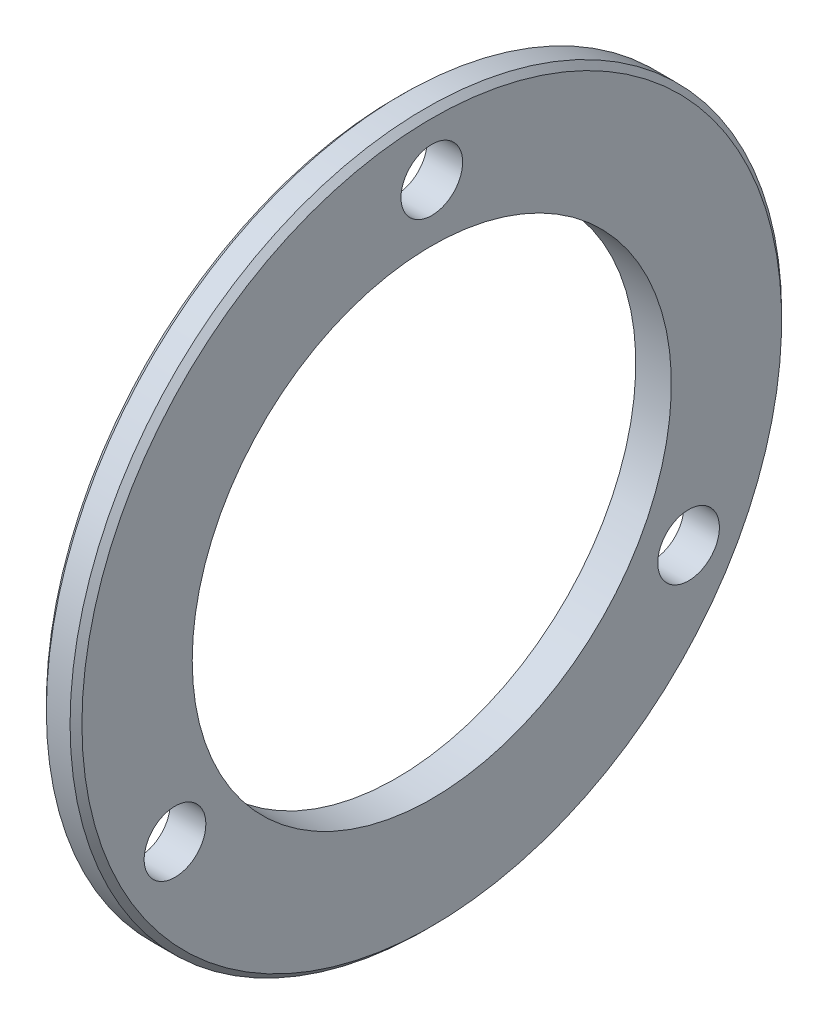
ISO-10303-21;
HEADER;
FILE_DESCRIPTION(('STEP AP214'),'2;1');
FILE_NAME('part.step','',(''),(''),'','','');
FILE_SCHEMA(('AUTOMOTIVE_DESIGN { 1 0 10303 214 1 1 1 1 }'));
ENDSEC;
DATA;
#1=APPLICATION_CONTEXT('core data for automotive mechanical design processes');
#2=APPLICATION_PROTOCOL_DEFINITION('international standard','automotive_design',2000,#1);
#3=PRODUCT_CONTEXT('',#1,'mechanical');
#4=PRODUCT('Part','Part','',(#3));
#5=PRODUCT_RELATED_PRODUCT_CATEGORY('part','',(#4));
#6=PRODUCT_DEFINITION_FORMATION('','',#4);
#7=PRODUCT_DEFINITION_CONTEXT('part definition',#1,'design');
#8=PRODUCT_DEFINITION('design','',#6,#7);
#9=PRODUCT_DEFINITION_SHAPE('','',#8);
#10=(LENGTH_UNIT() NAMED_UNIT(*) SI_UNIT(.MILLI.,.METRE.));
#11=(NAMED_UNIT(*) PLANE_ANGLE_UNIT() SI_UNIT($,.RADIAN.));
#12=(NAMED_UNIT(*) SI_UNIT($,.STERADIAN.) SOLID_ANGLE_UNIT());
#13=UNCERTAINTY_MEASURE_WITH_UNIT(LENGTH_MEASURE(1.E-05),#10,'distance_accuracy_value','');
#14=(GEOMETRIC_REPRESENTATION_CONTEXT(3) GLOBAL_UNCERTAINTY_ASSIGNED_CONTEXT((#13)) GLOBAL_UNIT_ASSIGNED_CONTEXT((#10,
#11,#12)) REPRESENTATION_CONTEXT('',''));
#15=CARTESIAN_POINT('',(0.,0.,0.));
#16=DIRECTION('',(0.,0.,1.));
#17=DIRECTION('',(1.,0.,0.));
#18=AXIS2_PLACEMENT_3D('',#15,#16,#17);
#19=CARTESIAN_POINT('',(0.,30.,0.));
#20=DIRECTION('',(1.,0.,0.));
#21=DIRECTION('',(0.,0.,-1.));
#22=AXIS2_PLACEMENT_3D('',#19,#20,#21);
#23=PLANE('',#22);
#24=CARTESIAN_POINT('',(0.,0.,0.));
#25=DIRECTION('',(1.,0.,0.));
#26=DIRECTION('',(0.,0.,-1.));
#27=AXIS2_PLACEMENT_3D('',#24,#25,#26);
#28=CIRCLE('',#27,29.5);
#29=CARTESIAN_POINT('',(0.,0.,-29.5));
#30=VERTEX_POINT('',#29);
#31=EDGE_CURVE('E49',#30,#30,#28,.F.);
#32=ORIENTED_EDGE('',*,*,#31,.T.);
#33=EDGE_LOOP('',(#32));
#34=FACE_BOUND('',#33,.T.);
#35=CARTESIAN_POINT('',(0.,-12.4999999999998,21.6506350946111));
#36=DIRECTION('',(1.,0.,0.));
#37=DIRECTION('',(0.,0.,-1.));
#38=AXIS2_PLACEMENT_3D('',#35,#36,#37);
#39=CIRCLE('',#38,2.6);
#40=CARTESIAN_POINT('',(0.,-12.4999999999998,19.0506350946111));
#41=VERTEX_POINT('',#40);
#42=EDGE_CURVE('E72',#41,#41,#39,.T.);
#43=ORIENTED_EDGE('',*,*,#42,.T.);
#44=EDGE_LOOP('',(#43));
#45=FACE_BOUND('',#44,.T.);
#46=CARTESIAN_POINT('',(0.,-12.5000000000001,-21.6506350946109));
#47=DIRECTION('',(1.,0.,0.));
#48=DIRECTION('',(0.,0.,-1.));
#49=AXIS2_PLACEMENT_3D('',#46,#47,#48);
#50=CIRCLE('',#49,2.6);
#51=CARTESIAN_POINT('',(0.,-12.5000000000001,-24.2506350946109));
#52=VERTEX_POINT('',#51);
#53=EDGE_CURVE('E66',#52,#52,#50,.T.);
#54=ORIENTED_EDGE('',*,*,#53,.T.);
#55=EDGE_LOOP('',(#54));
#56=FACE_BOUND('',#55,.T.);
#57=CARTESIAN_POINT('',(0.,25.,0.));
#58=DIRECTION('',(1.,0.,0.));
#59=DIRECTION('',(0.,0.,-1.));
#60=AXIS2_PLACEMENT_3D('',#57,#58,#59);
#61=CIRCLE('',#60,2.6);
#62=CARTESIAN_POINT('',(0.,25.,-2.6));
#63=VERTEX_POINT('',#62);
#64=EDGE_CURVE('E60',#63,#63,#61,.T.);
#65=ORIENTED_EDGE('',*,*,#64,.T.);
#66=EDGE_LOOP('',(#65));
#67=FACE_BOUND('',#66,.T.);
#68=CARTESIAN_POINT('',(0.,0.,0.));
#69=DIRECTION('',(-1.,0.,0.));
#70=DIRECTION('',(0.,0.,1.));
#71=AXIS2_PLACEMENT_3D('',#68,#69,#70);
#72=CIRCLE('',#71,20.2);
#73=CARTESIAN_POINT('',(0.,0.,20.2));
#74=VERTEX_POINT('',#73);
#75=EDGE_CURVE('E54',#74,#74,#72,.T.);
#76=ORIENTED_EDGE('',*,*,#75,.F.);
#77=EDGE_LOOP('',(#76));
#78=FACE_BOUND('',#77,.T.);
#79=ADVANCED_FACE('F34',(#34,#45,#56,#67,#78),#23,.F.);
#80=CARTESIAN_POINT('',(0.,0.,0.));
#81=DIRECTION('',(-1.,0.,0.));
#82=DIRECTION('',(0.,0.,1.));
#83=AXIS2_PLACEMENT_3D('',#80,#81,#82);
#84=CYLINDRICAL_SURFACE('',#83,20.2);
#85=CARTESIAN_POINT('',(3.,0.,0.));
#86=DIRECTION('',(-1.,0.,0.));
#87=DIRECTION('',(0.,0.,1.));
#88=AXIS2_PLACEMENT_3D('',#85,#86,#87);
#89=CIRCLE('',#88,20.2);
#90=CARTESIAN_POINT('',(3.,0.,20.2));
#91=VERTEX_POINT('',#90);
#92=EDGE_CURVE('E57',#91,#91,#89,.T.);
#93=ORIENTED_EDGE('',*,*,#92,.F.);
#94=EDGE_LOOP('',(#93));
#95=FACE_BOUND('',#94,.T.);
#96=ORIENTED_EDGE('',*,*,#75,.T.);
#97=EDGE_LOOP('',(#96));
#98=FACE_BOUND('',#97,.T.);
#99=ADVANCED_FACE('F85',(#95,#98),#84,.F.);
#100=CARTESIAN_POINT('',(3.,30.,0.));
#101=DIRECTION('',(-1.,0.,0.));
#102=DIRECTION('',(0.,0.,1.));
#103=AXIS2_PLACEMENT_3D('',#100,#101,#102);
#104=PLANE('',#103);
#105=CARTESIAN_POINT('',(3.,0.,0.));
#106=DIRECTION('',(-1.,0.,0.));
#107=DIRECTION('',(0.,0.,1.));
#108=AXIS2_PLACEMENT_3D('',#105,#106,#107);
#109=CIRCLE('',#108,29.5);
#110=CARTESIAN_POINT('',(3.,0.,29.5));
#111=VERTEX_POINT('',#110);
#112=EDGE_CURVE('E10',#111,#111,#109,.F.);
#113=ORIENTED_EDGE('',*,*,#112,.T.);
#114=EDGE_LOOP('',(#113));
#115=FACE_BOUND('',#114,.T.);
#116=CARTESIAN_POINT('',(3.,-12.4999999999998,21.6506350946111));
#117=DIRECTION('',(1.,0.,0.));
#118=DIRECTION('',(0.,0.,-1.));
#119=AXIS2_PLACEMENT_3D('',#116,#117,#118);
#120=CIRCLE('',#119,2.59999999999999);
#121=CARTESIAN_POINT('',(3.,-12.4999999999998,19.0506350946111));
#122=VERTEX_POINT('',#121);
#123=EDGE_CURVE('E75',#122,#122,#120,.T.);
#124=ORIENTED_EDGE('',*,*,#123,.F.);
#125=EDGE_LOOP('',(#124));
#126=FACE_BOUND('',#125,.T.);
#127=CARTESIAN_POINT('',(3.,-12.5000000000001,-21.6506350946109));
#128=DIRECTION('',(1.,0.,0.));
#129=DIRECTION('',(0.,0.,-1.));
#130=AXIS2_PLACEMENT_3D('',#127,#128,#129);
#131=CIRCLE('',#130,2.59999999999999);
#132=CARTESIAN_POINT('',(3.,-12.5000000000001,-24.2506350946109));
#133=VERTEX_POINT('',#132);
#134=EDGE_CURVE('E69',#133,#133,#131,.T.);
#135=ORIENTED_EDGE('',*,*,#134,.F.);
#136=EDGE_LOOP('',(#135));
#137=FACE_BOUND('',#136,.T.);
#138=CARTESIAN_POINT('',(3.,25.,0.));
#139=DIRECTION('',(1.,0.,0.));
#140=DIRECTION('',(0.,0.,-1.));
#141=AXIS2_PLACEMENT_3D('',#138,#139,#140);
#142=CIRCLE('',#141,2.59999999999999);
#143=CARTESIAN_POINT('',(3.,25.,-2.59999999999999));
#144=VERTEX_POINT('',#143);
#145=EDGE_CURVE('E63',#144,#144,#142,.T.);
#146=ORIENTED_EDGE('',*,*,#145,.F.);
#147=EDGE_LOOP('',(#146));
#148=FACE_BOUND('',#147,.T.);
#149=ORIENTED_EDGE('',*,*,#92,.T.);
#150=EDGE_LOOP('',(#149));
#151=FACE_BOUND('',#150,.T.);
#152=ADVANCED_FACE('F81',(#115,#126,#137,#148,#151),#104,.F.);
#153=CARTESIAN_POINT('',(0.,0.,0.));
#154=DIRECTION('',(-1.,0.,0.));
#155=DIRECTION('',(0.,0.,1.));
#156=AXIS2_PLACEMENT_3D('',#153,#154,#155);
#157=CYLINDRICAL_SURFACE('',#156,30.);
#158=CARTESIAN_POINT('',(0.500000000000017,0.,0.));
#159=DIRECTION('',(1.,0.,0.));
#160=DIRECTION('',(0.,0.,-1.));
#161=AXIS2_PLACEMENT_3D('',#158,#159,#160);
#162=CIRCLE('',#161,30.);
#163=CARTESIAN_POINT('',(0.500000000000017,0.,-30.));
#164=VERTEX_POINT('',#163);
#165=EDGE_CURVE('E41',#164,#164,#162,.T.);
#166=ORIENTED_EDGE('',*,*,#165,.T.);
#167=EDGE_LOOP('',(#166));
#168=FACE_BOUND('',#167,.T.);
#169=CARTESIAN_POINT('',(2.5,0.,0.));
#170=DIRECTION('',(-1.,0.,0.));
#171=DIRECTION('',(0.,0.,1.));
#172=AXIS2_PLACEMENT_3D('',#169,#170,#171);
#173=CIRCLE('',#172,30.);
#174=CARTESIAN_POINT('',(2.5,0.,30.));
#175=VERTEX_POINT('',#174);
#176=EDGE_CURVE('E45',#175,#175,#173,.T.);
#177=ORIENTED_EDGE('',*,*,#176,.T.);
#178=EDGE_LOOP('',(#177));
#179=FACE_BOUND('',#178,.T.);
#180=ADVANCED_FACE('F84',(#168,#179),#157,.T.);
#181=CARTESIAN_POINT('',(3.,25.,0.));
#182=DIRECTION('',(1.,0.,0.));
#183=DIRECTION('',(0.,0.,-1.));
#184=AXIS2_PLACEMENT_3D('',#181,#182,#183);
#185=CYLINDRICAL_SURFACE('',#184,2.59999999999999);
#186=ORIENTED_EDGE('',*,*,#64,.F.);
#187=EDGE_LOOP('',(#186));
#188=FACE_BOUND('',#187,.T.);
#189=ORIENTED_EDGE('',*,*,#145,.T.);
#190=EDGE_LOOP('',(#189));
#191=FACE_BOUND('',#190,.T.);
#192=ADVANCED_FACE('F120',(#188,#191),#185,.F.);
#193=CARTESIAN_POINT('',(3.,-12.5000000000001,-21.6506350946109));
#194=DIRECTION('',(1.,0.,0.));
#195=DIRECTION('',(0.,0.,-1.));
#196=AXIS2_PLACEMENT_3D('',#193,#194,#195);
#197=CYLINDRICAL_SURFACE('',#196,2.59999999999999);
#198=ORIENTED_EDGE('',*,*,#53,.F.);
#199=EDGE_LOOP('',(#198));
#200=FACE_BOUND('',#199,.T.);
#201=ORIENTED_EDGE('',*,*,#134,.T.);
#202=EDGE_LOOP('',(#201));
#203=FACE_BOUND('',#202,.T.);
#204=ADVANCED_FACE('F112',(#200,#203),#197,.F.);
#205=CARTESIAN_POINT('',(3.,-12.4999999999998,21.6506350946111));
#206=DIRECTION('',(1.,0.,0.));
#207=DIRECTION('',(0.,0.,-1.));
#208=AXIS2_PLACEMENT_3D('',#205,#206,#207);
#209=CYLINDRICAL_SURFACE('',#208,2.59999999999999);
#210=ORIENTED_EDGE('',*,*,#42,.F.);
#211=EDGE_LOOP('',(#210));
#212=FACE_BOUND('',#211,.T.);
#213=ORIENTED_EDGE('',*,*,#123,.T.);
#214=EDGE_LOOP('',(#213));
#215=FACE_BOUND('',#214,.T.);
#216=ADVANCED_FACE('F79',(#212,#215),#209,.F.);
#217=CARTESIAN_POINT('',(0.,0.,0.));
#218=DIRECTION('',(1.,0.,0.));
#219=DIRECTION('',(0.,0.,-1.));
#220=AXIS2_PLACEMENT_3D('',#217,#218,#219);
#221=CONICAL_SURFACE('',#220,29.5,0.785398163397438);
#222=ORIENTED_EDGE('',*,*,#165,.F.);
#223=EDGE_LOOP('',(#222));
#224=FACE_BOUND('',#223,.T.);
#225=ORIENTED_EDGE('',*,*,#31,.F.);
#226=EDGE_LOOP('',(#225));
#227=FACE_BOUND('',#226,.T.);
#228=ADVANCED_FACE('F104',(#224,#227),#221,.T.);
#229=CARTESIAN_POINT('',(2.5,0.,0.));
#230=DIRECTION('',(-1.,0.,0.));
#231=DIRECTION('',(0.,0.,1.));
#232=AXIS2_PLACEMENT_3D('',#229,#230,#231);
#233=CONICAL_SURFACE('',#232,30.,0.785398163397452);
#234=ORIENTED_EDGE('',*,*,#112,.F.);
#235=EDGE_LOOP('',(#234));
#236=FACE_BOUND('',#235,.T.);
#237=ORIENTED_EDGE('',*,*,#176,.F.);
#238=EDGE_LOOP('',(#237));
#239=FACE_BOUND('',#238,.T.);
#240=ADVANCED_FACE('F36',(#236,#239),#233,.T.);
#241=CLOSED_SHELL('',(#79,#99,#152,#180,#192,#204,#216,#228,#240));
#242=MANIFOLD_SOLID_BREP('B2',#241);
#243=ADVANCED_BREP_SHAPE_REPRESENTATION('',(#18,#242),#14);
#244=SHAPE_DEFINITION_REPRESENTATION(#9,#243);
ENDSEC;
END-ISO-10303-21;
